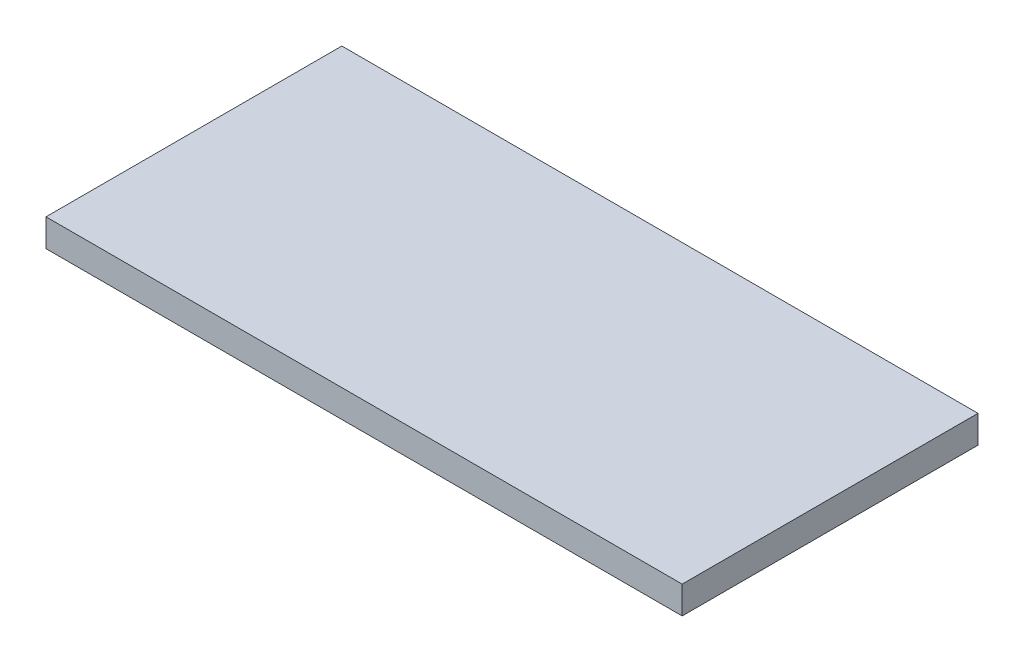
from build123d import *

# Parameters (mm, degrees)
SKETCH1_W      = 69.127993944
SKETCH1_H      = 32.145482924
EXTRUDE1_DEPTH = 3


with BuildPart() as part:
    # Sketch1 → Extrude1 (new body)
    with BuildSketch(Plane(origin=(0, 0, 0), x_dir=(1, 0, 0), z_dir=(0, 1, 0))):
        Rectangle(SKETCH1_W, SKETCH1_H)
    extrude(amount=EXTRUDE1_DEPTH)


solid = part.part
